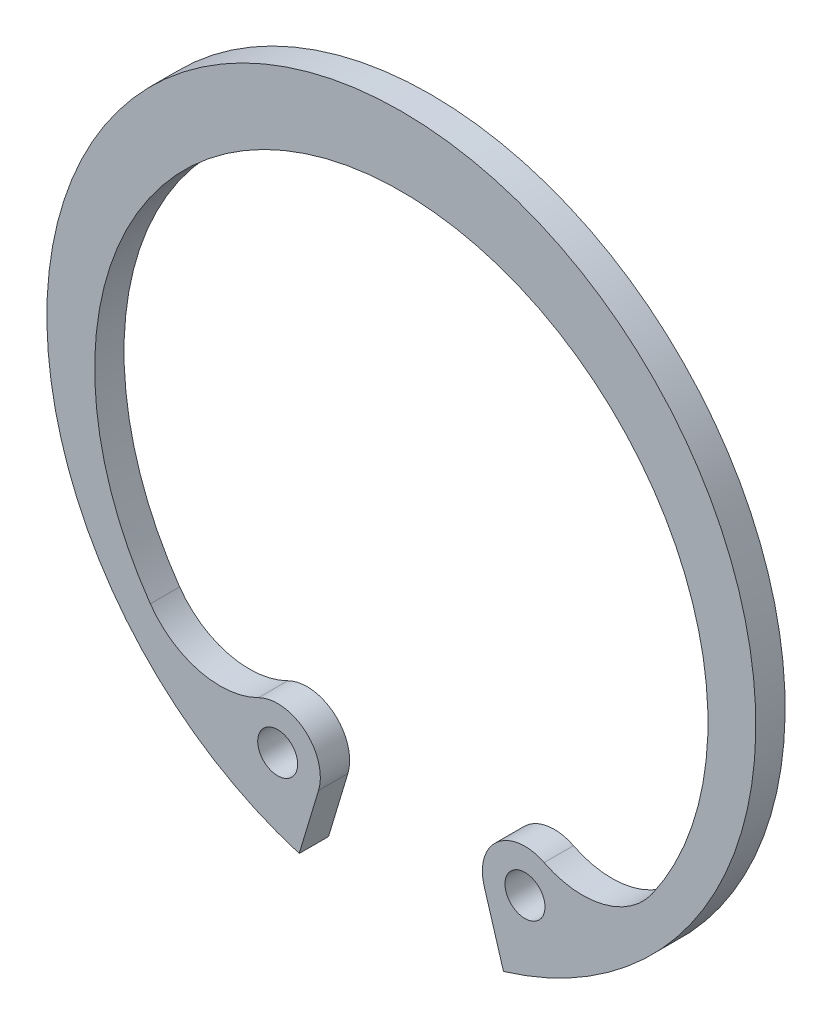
ISO-10303-21;
HEADER;
FILE_DESCRIPTION(('STEP AP214'),'2;1');
FILE_NAME('part.step','',(''),(''),'','','');
FILE_SCHEMA(('AUTOMOTIVE_DESIGN { 1 0 10303 214 1 1 1 1 }'));
ENDSEC;
DATA;
#1=APPLICATION_CONTEXT('core data for automotive mechanical design processes');
#2=APPLICATION_PROTOCOL_DEFINITION('international standard','automotive_design',2000,#1);
#3=PRODUCT_CONTEXT('',#1,'mechanical');
#4=PRODUCT('Part','Part','',(#3));
#5=PRODUCT_RELATED_PRODUCT_CATEGORY('part','',(#4));
#6=PRODUCT_DEFINITION_FORMATION('','',#4);
#7=PRODUCT_DEFINITION_CONTEXT('part definition',#1,'design');
#8=PRODUCT_DEFINITION('design','',#6,#7);
#9=PRODUCT_DEFINITION_SHAPE('','',#8);
#10=(LENGTH_UNIT() NAMED_UNIT(*) SI_UNIT(.MILLI.,.METRE.));
#11=(NAMED_UNIT(*) PLANE_ANGLE_UNIT() SI_UNIT($,.RADIAN.));
#12=(NAMED_UNIT(*) SI_UNIT($,.STERADIAN.) SOLID_ANGLE_UNIT());
#13=UNCERTAINTY_MEASURE_WITH_UNIT(LENGTH_MEASURE(1.E-05),#10,'distance_accuracy_value','');
#14=(GEOMETRIC_REPRESENTATION_CONTEXT(3) GLOBAL_UNCERTAINTY_ASSIGNED_CONTEXT((#13)) GLOBAL_UNIT_ASSIGNED_CONTEXT((#10,
#11,#12)) REPRESENTATION_CONTEXT('',''));
#15=CARTESIAN_POINT('',(0.,0.,0.));
#16=DIRECTION('',(0.,0.,1.));
#17=DIRECTION('',(1.,0.,0.));
#18=AXIS2_PLACEMENT_3D('',#15,#16,#17);
#19=CARTESIAN_POINT('',(0.,0.,-1.1));
#20=DIRECTION('',(0.,0.,1.));
#21=DIRECTION('',(1.,0.,0.));
#22=AXIS2_PLACEMENT_3D('',#19,#20,#21);
#23=CYLINDRICAL_SURFACE('',#22,13.3);
#24=CARTESIAN_POINT('',(0.,0.,0.));
#25=DIRECTION('',(0.,0.,1.));
#26=DIRECTION('',(1.,0.,0.));
#27=AXIS2_PLACEMENT_3D('',#24,#25,#26);
#28=CIRCLE('',#27,13.3);
#29=CARTESIAN_POINT('',(3.83259254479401,-12.7358248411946,0.));
#30=VERTEX_POINT('',#29);
#31=CARTESIAN_POINT('',(-3.83259254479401,-12.7358248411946,0.));
#32=VERTEX_POINT('',#31);
#33=EDGE_CURVE('E130',#30,#32,#28,.T.);
#34=ORIENTED_EDGE('',*,*,#33,.F.);
#35=DIRECTION('',(0.,0.,1.));
#36=VECTOR('',#35,1.);
#37=CARTESIAN_POINT('',(3.83259254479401,-12.7358248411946,-1.1));
#38=LINE('',#37,#36);
#39=CARTESIAN_POINT('',(3.83259254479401,-12.7358248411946,-1.1));
#40=VERTEX_POINT('',#39);
#41=EDGE_CURVE('E11',#40,#30,#38,.T.);
#42=ORIENTED_EDGE('',*,*,#41,.F.);
#43=CARTESIAN_POINT('',(0.,0.,-1.1));
#44=DIRECTION('',(0.,0.,1.));
#45=DIRECTION('',(1.,0.,0.));
#46=AXIS2_PLACEMENT_3D('',#43,#44,#45);
#47=CIRCLE('',#46,13.3);
#48=CARTESIAN_POINT('',(-3.83259254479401,-12.7358248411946,-1.1));
#49=VERTEX_POINT('',#48);
#50=EDGE_CURVE('E151',#40,#49,#47,.T.);
#51=ORIENTED_EDGE('',*,*,#50,.T.);
#52=DIRECTION('',(0.,0.,1.));
#53=VECTOR('',#52,1.);
#54=CARTESIAN_POINT('',(-3.83259254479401,-12.7358248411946,-1.1));
#55=LINE('',#54,#53);
#56=EDGE_CURVE('E36',#49,#32,#55,.T.);
#57=ORIENTED_EDGE('',*,*,#56,.T.);
#58=EDGE_LOOP('',(#34,#42,#51,#57));
#59=FACE_BOUND('',#58,.T.);
#60=ADVANCED_FACE('F33',(#59),#23,.T.);
#61=CARTESIAN_POINT('',(3.83259254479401,-12.7358248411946,-1.1));
#62=DIRECTION('',(-0.957580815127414,-0.288164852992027,0.));
#63=DIRECTION('',(0.288164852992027,-0.957580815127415,0.));
#64=AXIS2_PLACEMENT_3D('',#61,#62,#63);
#65=PLANE('',#64);
#66=DIRECTION('',(0.288164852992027,-0.957580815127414,0.));
#67=VECTOR('',#66,1.);
#68=CARTESIAN_POINT('',(3.83259254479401,-12.7358248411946,0.));
#69=LINE('',#68,#67);
#70=CARTESIAN_POINT('',(3.10697307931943,-10.3245686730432,0.));
#71=VERTEX_POINT('',#70);
#72=EDGE_CURVE('E149',#71,#30,#69,.T.);
#73=ORIENTED_EDGE('',*,*,#72,.F.);
#74=DIRECTION('',(0.,0.,1.));
#75=VECTOR('',#74,1.);
#76=CARTESIAN_POINT('',(3.10697307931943,-10.3245686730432,-1.1));
#77=LINE('',#76,#75);
#78=CARTESIAN_POINT('',(3.10697307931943,-10.3245686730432,-1.1));
#79=VERTEX_POINT('',#78);
#80=EDGE_CURVE('E42',#79,#71,#77,.T.);
#81=ORIENTED_EDGE('',*,*,#80,.F.);
#82=DIRECTION('',(0.288164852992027,-0.957580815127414,0.));
#83=VECTOR('',#82,1.);
#84=CARTESIAN_POINT('',(3.83259254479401,-12.7358248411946,-1.1));
#85=LINE('',#84,#83);
#86=EDGE_CURVE('E120',#79,#40,#85,.T.);
#87=ORIENTED_EDGE('',*,*,#86,.T.);
#88=ORIENTED_EDGE('',*,*,#41,.T.);
#89=EDGE_LOOP('',(#73,#81,#87,#88));
#90=FACE_BOUND('',#89,.T.);
#91=ADVANCED_FACE('F163',(#90),#65,.T.);
#92=CARTESIAN_POINT('',(4.63910238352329,-9.86350490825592,-1.1));
#93=DIRECTION('',(0.,0.,1.));
#94=DIRECTION('',(1.,0.,0.));
#95=AXIS2_PLACEMENT_3D('',#92,#93,#94);
#96=CYLINDRICAL_SURFACE('',#95,1.6);
#97=CARTESIAN_POINT('',(4.63910238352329,-9.86350490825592,0.));
#98=DIRECTION('',(0.,0.,1.));
#99=DIRECTION('',(1.,0.,0.));
#100=AXIS2_PLACEMENT_3D('',#97,#98,#99);
#101=CIRCLE('',#100,1.6);
#102=CARTESIAN_POINT('',(5.35901450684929,-8.43461494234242,0.));
#103=VERTEX_POINT('',#102);
#104=EDGE_CURVE('E107',#103,#71,#101,.T.);
#105=ORIENTED_EDGE('',*,*,#104,.F.);
#106=DIRECTION('',(0.,0.,1.));
#107=VECTOR('',#106,1.);
#108=CARTESIAN_POINT('',(5.35901450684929,-8.43461494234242,-1.1));
#109=LINE('',#108,#107);
#110=CARTESIAN_POINT('',(5.35901450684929,-8.43461494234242,-1.1));
#111=VERTEX_POINT('',#110);
#112=EDGE_CURVE('E102',#111,#103,#109,.T.);
#113=ORIENTED_EDGE('',*,*,#112,.F.);
#114=CARTESIAN_POINT('',(4.63910238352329,-9.86350490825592,-1.1));
#115=DIRECTION('',(0.,0.,1.));
#116=DIRECTION('',(1.,0.,0.));
#117=AXIS2_PLACEMENT_3D('',#114,#115,#116);
#118=CIRCLE('',#117,1.6);
#119=EDGE_CURVE('E105',#111,#79,#118,.T.);
#120=ORIENTED_EDGE('',*,*,#119,.T.);
#121=ORIENTED_EDGE('',*,*,#80,.T.);
#122=EDGE_LOOP('',(#105,#113,#120,#121));
#123=FACE_BOUND('',#122,.T.);
#124=ADVANCED_FACE('F104',(#123),#96,.T.);
#125=CARTESIAN_POINT('',(6.79883875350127,-5.57683501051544,-1.1));
#126=DIRECTION('',(0.,0.,1.));
#127=DIRECTION('',(1.,0.,0.));
#128=AXIS2_PLACEMENT_3D('',#125,#126,#127);
#129=CYLINDRICAL_SURFACE('',#128,3.2);
#130=CARTESIAN_POINT('',(6.79883875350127,-5.57683501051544,0.));
#131=DIRECTION('',(0.,0.,-1.));
#132=DIRECTION('',(1.,0.,0.));
#133=AXIS2_PLACEMENT_3D('',#130,#131,#132);
#134=CIRCLE('',#133,3.2);
#135=CARTESIAN_POINT('',(9.41823928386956,-7.41497016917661,0.));
#136=VERTEX_POINT('',#135);
#137=EDGE_CURVE('E146',#136,#103,#134,.T.);
#138=ORIENTED_EDGE('',*,*,#137,.F.);
#139=DIRECTION('',(0.,0.,1.));
#140=VECTOR('',#139,1.);
#141=CARTESIAN_POINT('',(9.41823928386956,-7.41497016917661,-1.1));
#142=LINE('',#141,#140);
#143=CARTESIAN_POINT('',(9.41823928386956,-7.41497016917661,-1.1));
#144=VERTEX_POINT('',#143);
#145=EDGE_CURVE('E112',#144,#136,#142,.T.);
#146=ORIENTED_EDGE('',*,*,#145,.F.);
#147=CARTESIAN_POINT('',(6.79883875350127,-5.57683501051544,-1.1));
#148=DIRECTION('',(0.,0.,-1.));
#149=DIRECTION('',(1.,0.,0.));
#150=AXIS2_PLACEMENT_3D('',#147,#148,#149);
#151=CIRCLE('',#150,3.2);
#152=EDGE_CURVE('E118',#144,#111,#151,.T.);
#153=ORIENTED_EDGE('',*,*,#152,.T.);
#154=ORIENTED_EDGE('',*,*,#112,.T.);
#155=EDGE_LOOP('',(#138,#146,#153,#154));
#156=FACE_BOUND('',#155,.T.);
#157=ADVANCED_FACE('F122',(#156),#129,.F.);
#158=CARTESIAN_POINT('',(0.,-0.80582561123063,-1.1));
#159=DIRECTION('',(0.,0.,1.));
#160=DIRECTION('',(1.,0.,0.));
#161=AXIS2_PLACEMENT_3D('',#158,#159,#160);
#162=CYLINDRICAL_SURFACE('',#161,11.5058256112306);
#163=CARTESIAN_POINT('',(0.,-0.80582561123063,0.));
#164=DIRECTION('',(0.,0.,-1.));
#165=DIRECTION('',(1.,0.,0.));
#166=AXIS2_PLACEMENT_3D('',#163,#164,#165);
#167=CIRCLE('',#166,11.5058256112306);
#168=CARTESIAN_POINT('',(-9.41823928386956,-7.41497016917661,0.));
#169=VERTEX_POINT('',#168);
#170=EDGE_CURVE('E143',#169,#136,#167,.T.);
#171=ORIENTED_EDGE('',*,*,#170,.F.);
#172=DIRECTION('',(0.,0.,1.));
#173=VECTOR('',#172,1.);
#174=CARTESIAN_POINT('',(-9.41823928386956,-7.41497016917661,-1.1));
#175=LINE('',#174,#173);
#176=CARTESIAN_POINT('',(-9.41823928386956,-7.41497016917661,-1.1));
#177=VERTEX_POINT('',#176);
#178=EDGE_CURVE('E155',#177,#169,#175,.T.);
#179=ORIENTED_EDGE('',*,*,#178,.F.);
#180=CARTESIAN_POINT('',(0.,-0.80582561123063,-1.1));
#181=DIRECTION('',(0.,0.,-1.));
#182=DIRECTION('',(1.,0.,0.));
#183=AXIS2_PLACEMENT_3D('',#180,#181,#182);
#184=CIRCLE('',#183,11.5058256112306);
#185=EDGE_CURVE('E123',#177,#144,#184,.T.);
#186=ORIENTED_EDGE('',*,*,#185,.T.);
#187=ORIENTED_EDGE('',*,*,#145,.T.);
#188=EDGE_LOOP('',(#171,#179,#186,#187));
#189=FACE_BOUND('',#188,.T.);
#190=ADVANCED_FACE('F176',(#189),#162,.F.);
#191=CARTESIAN_POINT('',(-6.79883875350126,-5.57683501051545,-1.1));
#192=DIRECTION('',(0.,0.,1.));
#193=DIRECTION('',(1.,0.,0.));
#194=AXIS2_PLACEMENT_3D('',#191,#192,#193);
#195=CYLINDRICAL_SURFACE('',#194,3.2);
#196=CARTESIAN_POINT('',(-6.79883875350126,-5.57683501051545,0.));
#197=DIRECTION('',(0.,0.,-1.));
#198=DIRECTION('',(1.,0.,0.));
#199=AXIS2_PLACEMENT_3D('',#196,#197,#198);
#200=CIRCLE('',#199,3.2);
#201=CARTESIAN_POINT('',(-5.35901450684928,-8.43461494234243,0.));
#202=VERTEX_POINT('',#201);
#203=EDGE_CURVE('E140',#202,#169,#200,.T.);
#204=ORIENTED_EDGE('',*,*,#203,.F.);
#205=DIRECTION('',(0.,0.,1.));
#206=VECTOR('',#205,1.);
#207=CARTESIAN_POINT('',(-5.35901450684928,-8.43461494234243,-1.1));
#208=LINE('',#207,#206);
#209=CARTESIAN_POINT('',(-5.35901450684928,-8.43461494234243,-1.1));
#210=VERTEX_POINT('',#209);
#211=EDGE_CURVE('E157',#210,#202,#208,.T.);
#212=ORIENTED_EDGE('',*,*,#211,.F.);
#213=CARTESIAN_POINT('',(-6.79883875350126,-5.57683501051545,-1.1));
#214=DIRECTION('',(0.,0.,-1.));
#215=DIRECTION('',(1.,0.,0.));
#216=AXIS2_PLACEMENT_3D('',#213,#214,#215);
#217=CIRCLE('',#216,3.2);
#218=EDGE_CURVE('E125',#210,#177,#217,.T.);
#219=ORIENTED_EDGE('',*,*,#218,.T.);
#220=ORIENTED_EDGE('',*,*,#178,.T.);
#221=EDGE_LOOP('',(#204,#212,#219,#220));
#222=FACE_BOUND('',#221,.T.);
#223=ADVANCED_FACE('F179',(#222),#195,.F.);
#224=CARTESIAN_POINT('',(-4.63910238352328,-9.86350490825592,-1.1));
#225=DIRECTION('',(0.,0.,1.));
#226=DIRECTION('',(1.,0.,0.));
#227=AXIS2_PLACEMENT_3D('',#224,#225,#226);
#228=CYLINDRICAL_SURFACE('',#227,1.6);
#229=CARTESIAN_POINT('',(-4.63910238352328,-9.86350490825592,0.));
#230=DIRECTION('',(0.,0.,1.));
#231=DIRECTION('',(1.,0.,0.));
#232=AXIS2_PLACEMENT_3D('',#229,#230,#231);
#233=CIRCLE('',#232,1.6);
#234=CARTESIAN_POINT('',(-3.10697307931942,-10.3245686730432,0.));
#235=VERTEX_POINT('',#234);
#236=EDGE_CURVE('E137',#235,#202,#233,.T.);
#237=ORIENTED_EDGE('',*,*,#236,.F.);
#238=DIRECTION('',(0.,0.,1.));
#239=VECTOR('',#238,1.);
#240=CARTESIAN_POINT('',(-3.10697307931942,-10.3245686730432,-1.1));
#241=LINE('',#240,#239);
#242=CARTESIAN_POINT('',(-3.10697307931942,-10.3245686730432,-1.1));
#243=VERTEX_POINT('',#242);
#244=EDGE_CURVE('E158',#243,#235,#241,.T.);
#245=ORIENTED_EDGE('',*,*,#244,.F.);
#246=CARTESIAN_POINT('',(-4.63910238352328,-9.86350490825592,-1.1));
#247=DIRECTION('',(0.,0.,1.));
#248=DIRECTION('',(1.,0.,0.));
#249=AXIS2_PLACEMENT_3D('',#246,#247,#248);
#250=CIRCLE('',#249,1.6);
#251=EDGE_CURVE('E225',#243,#210,#250,.T.);
#252=ORIENTED_EDGE('',*,*,#251,.T.);
#253=ORIENTED_EDGE('',*,*,#211,.T.);
#254=EDGE_LOOP('',(#237,#245,#252,#253));
#255=FACE_BOUND('',#254,.T.);
#256=ADVANCED_FACE('F183',(#255),#228,.T.);
#257=CARTESIAN_POINT('',(-3.83259254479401,-12.7358248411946,-1.1));
#258=DIRECTION('',(0.957580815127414,-0.288164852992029,0.));
#259=DIRECTION('',(0.288164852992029,0.957580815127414,0.));
#260=AXIS2_PLACEMENT_3D('',#257,#258,#259);
#261=PLANE('',#260);
#262=DIRECTION('',(0.288164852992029,0.957580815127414,0.));
#263=VECTOR('',#262,1.);
#264=CARTESIAN_POINT('',(-3.83259254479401,-12.7358248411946,0.));
#265=LINE('',#264,#263);
#266=EDGE_CURVE('E133',#32,#235,#265,.T.);
#267=ORIENTED_EDGE('',*,*,#266,.F.);
#268=ORIENTED_EDGE('',*,*,#56,.F.);
#269=DIRECTION('',(0.288164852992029,0.957580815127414,0.));
#270=VECTOR('',#269,1.);
#271=CARTESIAN_POINT('',(-3.83259254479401,-12.7358248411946,-1.1));
#272=LINE('',#271,#270);
#273=EDGE_CURVE('E223',#49,#243,#272,.T.);
#274=ORIENTED_EDGE('',*,*,#273,.T.);
#275=ORIENTED_EDGE('',*,*,#244,.T.);
#276=EDGE_LOOP('',(#267,#268,#274,#275));
#277=FACE_BOUND('',#276,.T.);
#278=ADVANCED_FACE('F160',(#277),#261,.T.);
#279=CARTESIAN_POINT('',(0.,0.,-1.1));
#280=DIRECTION('',(0.,0.,1.));
#281=DIRECTION('',(1.,0.,0.));
#282=AXIS2_PLACEMENT_3D('',#279,#280,#281);
#283=PLANE('',#282);
#284=CARTESIAN_POINT('',(-4.63910238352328,-9.86350490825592,-1.1));
#285=DIRECTION('',(0.,0.,1.));
#286=DIRECTION('',(1.,0.,0.));
#287=AXIS2_PLACEMENT_3D('',#284,#285,#286);
#288=CIRCLE('',#287,0.750000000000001);
#289=CARTESIAN_POINT('',(-3.88910238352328,-9.86350490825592,-1.1));
#290=VERTEX_POINT('',#289);
#291=EDGE_CURVE('E210',#290,#290,#288,.T.);
#292=ORIENTED_EDGE('',*,*,#291,.T.);
#293=EDGE_LOOP('',(#292));
#294=FACE_BOUND('',#293,.T.);
#295=CARTESIAN_POINT('',(4.63910238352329,-9.86350490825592,-1.1));
#296=DIRECTION('',(0.,0.,1.));
#297=DIRECTION('',(1.,0.,0.));
#298=AXIS2_PLACEMENT_3D('',#295,#296,#297);
#299=CIRCLE('',#298,0.75);
#300=CARTESIAN_POINT('',(5.38910238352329,-9.86350490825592,-1.1));
#301=VERTEX_POINT('',#300);
#302=EDGE_CURVE('E134',#301,#301,#299,.T.);
#303=ORIENTED_EDGE('',*,*,#302,.T.);
#304=EDGE_LOOP('',(#303));
#305=FACE_BOUND('',#304,.T.);
#306=ORIENTED_EDGE('',*,*,#50,.F.);
#307=ORIENTED_EDGE('',*,*,#86,.F.);
#308=ORIENTED_EDGE('',*,*,#119,.F.);
#309=ORIENTED_EDGE('',*,*,#152,.F.);
#310=ORIENTED_EDGE('',*,*,#185,.F.);
#311=ORIENTED_EDGE('',*,*,#218,.F.);
#312=ORIENTED_EDGE('',*,*,#251,.F.);
#313=ORIENTED_EDGE('',*,*,#273,.F.);
#314=EDGE_LOOP('',(#306,#307,#308,#309,#310,#311,#312,#313));
#315=FACE_BOUND('',#314,.T.);
#316=ADVANCED_FACE('F116',(#294,#305,#315),#283,.F.);
#317=CARTESIAN_POINT('',(0.,0.,0.));
#318=DIRECTION('',(0.,0.,1.));
#319=DIRECTION('',(1.,0.,0.));
#320=AXIS2_PLACEMENT_3D('',#317,#318,#319);
#321=PLANE('',#320);
#322=CARTESIAN_POINT('',(-4.63910238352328,-9.86350490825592,0.));
#323=DIRECTION('',(0.,0.,1.));
#324=DIRECTION('',(1.,0.,0.));
#325=AXIS2_PLACEMENT_3D('',#322,#323,#324);
#326=CIRCLE('',#325,0.750000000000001);
#327=CARTESIAN_POINT('',(-3.88910238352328,-9.86350490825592,0.));
#328=VERTEX_POINT('',#327);
#329=EDGE_CURVE('E213',#328,#328,#326,.T.);
#330=ORIENTED_EDGE('',*,*,#329,.F.);
#331=EDGE_LOOP('',(#330));
#332=FACE_BOUND('',#331,.T.);
#333=CARTESIAN_POINT('',(4.63910238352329,-9.86350490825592,0.));
#334=DIRECTION('',(0.,0.,1.));
#335=DIRECTION('',(1.,0.,0.));
#336=AXIS2_PLACEMENT_3D('',#333,#334,#335);
#337=CIRCLE('',#336,0.75);
#338=CARTESIAN_POINT('',(5.38910238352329,-9.86350490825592,0.));
#339=VERTEX_POINT('',#338);
#340=EDGE_CURVE('E215',#339,#339,#337,.T.);
#341=ORIENTED_EDGE('',*,*,#340,.F.);
#342=EDGE_LOOP('',(#341));
#343=FACE_BOUND('',#342,.T.);
#344=ORIENTED_EDGE('',*,*,#33,.T.);
#345=ORIENTED_EDGE('',*,*,#266,.T.);
#346=ORIENTED_EDGE('',*,*,#236,.T.);
#347=ORIENTED_EDGE('',*,*,#203,.T.);
#348=ORIENTED_EDGE('',*,*,#170,.T.);
#349=ORIENTED_EDGE('',*,*,#137,.T.);
#350=ORIENTED_EDGE('',*,*,#104,.T.);
#351=ORIENTED_EDGE('',*,*,#72,.T.);
#352=EDGE_LOOP('',(#344,#345,#346,#347,#348,#349,#350,#351));
#353=FACE_BOUND('',#352,.T.);
#354=ADVANCED_FACE('F162',(#332,#343,#353),#321,.T.);
#355=CARTESIAN_POINT('',(4.63910238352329,-9.86350490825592,-1.1));
#356=DIRECTION('',(0.,0.,1.));
#357=DIRECTION('',(1.,0.,0.));
#358=AXIS2_PLACEMENT_3D('',#355,#356,#357);
#359=CYLINDRICAL_SURFACE('',#358,0.75);
#360=ORIENTED_EDGE('',*,*,#302,.F.);
#361=EDGE_LOOP('',(#360));
#362=FACE_BOUND('',#361,.T.);
#363=ORIENTED_EDGE('',*,*,#340,.T.);
#364=EDGE_LOOP('',(#363));
#365=FACE_BOUND('',#364,.T.);
#366=ADVANCED_FACE('F195',(#362,#365),#359,.F.);
#367=CARTESIAN_POINT('',(-4.63910238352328,-9.86350490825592,-1.1));
#368=DIRECTION('',(0.,0.,1.));
#369=DIRECTION('',(1.,0.,0.));
#370=AXIS2_PLACEMENT_3D('',#367,#368,#369);
#371=CYLINDRICAL_SURFACE('',#370,0.750000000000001);
#372=ORIENTED_EDGE('',*,*,#291,.F.);
#373=EDGE_LOOP('',(#372));
#374=FACE_BOUND('',#373,.T.);
#375=ORIENTED_EDGE('',*,*,#329,.T.);
#376=EDGE_LOOP('',(#375));
#377=FACE_BOUND('',#376,.T.);
#378=ADVANCED_FACE('F202',(#374,#377),#371,.F.);
#379=CLOSED_SHELL('',(#60,#91,#124,#157,#190,#223,#256,#278,#316,#354,#366,#378));
#380=MANIFOLD_SOLID_BREP('B2',#379);
#381=ADVANCED_BREP_SHAPE_REPRESENTATION('',(#18,#380),#14);
#382=SHAPE_DEFINITION_REPRESENTATION(#9,#381);
ENDSEC;
END-ISO-10303-21;
